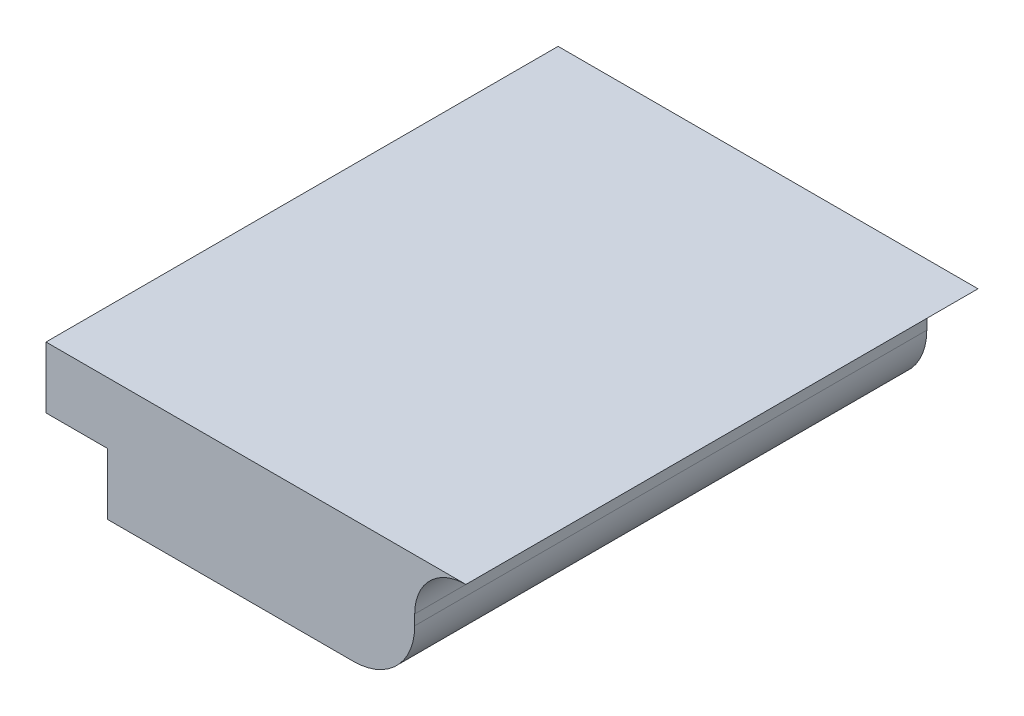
ISO-10303-21;
HEADER;
FILE_DESCRIPTION(('STEP AP214'),'2;1');
FILE_NAME('part.step','',(''),(''),'','','');
FILE_SCHEMA(('AUTOMOTIVE_DESIGN { 1 0 10303 214 1 1 1 1 }'));
ENDSEC;
DATA;
#1=APPLICATION_CONTEXT('core data for automotive mechanical design processes');
#2=APPLICATION_PROTOCOL_DEFINITION('international standard','automotive_design',2000,#1);
#3=PRODUCT_CONTEXT('',#1,'mechanical');
#4=PRODUCT('Part','Part','',(#3));
#5=PRODUCT_RELATED_PRODUCT_CATEGORY('part','',(#4));
#6=PRODUCT_DEFINITION_FORMATION('','',#4);
#7=PRODUCT_DEFINITION_CONTEXT('part definition',#1,'design');
#8=PRODUCT_DEFINITION('design','',#6,#7);
#9=PRODUCT_DEFINITION_SHAPE('','',#8);
#10=(LENGTH_UNIT() NAMED_UNIT(*) SI_UNIT(.MILLI.,.METRE.));
#11=(NAMED_UNIT(*) PLANE_ANGLE_UNIT() SI_UNIT($,.RADIAN.));
#12=(NAMED_UNIT(*) SI_UNIT($,.STERADIAN.) SOLID_ANGLE_UNIT());
#13=UNCERTAINTY_MEASURE_WITH_UNIT(LENGTH_MEASURE(1.E-05),#10,'distance_accuracy_value','');
#14=(GEOMETRIC_REPRESENTATION_CONTEXT(3) GLOBAL_UNCERTAINTY_ASSIGNED_CONTEXT((#13)) GLOBAL_UNIT_ASSIGNED_CONTEXT((#10,
#11,#12)) REPRESENTATION_CONTEXT('',''));
#15=CARTESIAN_POINT('',(0.,0.,0.));
#16=DIRECTION('',(0.,0.,1.));
#17=DIRECTION('',(1.,0.,0.));
#18=AXIS2_PLACEMENT_3D('',#15,#16,#17);
#19=CARTESIAN_POINT('',(9.,0.,12.5));
#20=DIRECTION('',(1.,0.,0.));
#21=DIRECTION('',(0.,0.,-1.));
#22=AXIS2_PLACEMENT_3D('',#19,#20,#21);
#23=PLANE('',#22);
#24=DIRECTION('',(0.,-1.,0.));
#25=VECTOR('',#24,1.);
#26=CARTESIAN_POINT('',(9.,0.,12.5));
#27=LINE('',#26,#25);
#28=CARTESIAN_POINT('',(9.,-2.5,12.5));
#29=VERTEX_POINT('',#28);
#30=CARTESIAN_POINT('',(9.,-3.,12.5));
#31=VERTEX_POINT('',#30);
#32=EDGE_CURVE('E118',#29,#31,#27,.T.);
#33=ORIENTED_EDGE('',*,*,#32,.T.);
#34=DIRECTION('',(0.,0.,-1.));
#35=VECTOR('',#34,1.);
#36=CARTESIAN_POINT('',(9.,-3.,12.5));
#37=LINE('',#36,#35);
#38=CARTESIAN_POINT('',(9.,-3.,-12.5));
#39=VERTEX_POINT('',#38);
#40=EDGE_CURVE('E124',#31,#39,#37,.T.);
#41=ORIENTED_EDGE('',*,*,#40,.T.);
#42=DIRECTION('',(0.,-1.,0.));
#43=VECTOR('',#42,1.);
#44=CARTESIAN_POINT('',(9.,0.,-12.5));
#45=LINE('',#44,#43);
#46=CARTESIAN_POINT('',(9.,-2.5,-12.5));
#47=VERTEX_POINT('',#46);
#48=EDGE_CURVE('E133',#47,#39,#45,.T.);
#49=ORIENTED_EDGE('',*,*,#48,.F.);
#50=DIRECTION('',(0.,0.,-1.));
#51=VECTOR('',#50,1.);
#52=CARTESIAN_POINT('',(9.,-2.5,12.5));
#53=LINE('',#52,#51);
#54=EDGE_CURVE('E108',#47,#29,#53,.F.);
#55=ORIENTED_EDGE('',*,*,#54,.T.);
#56=EDGE_LOOP('',(#33,#41,#49,#55));
#57=FACE_BOUND('',#56,.T.);
#58=ADVANCED_FACE('F36',(#57),#23,.T.);
#59=CARTESIAN_POINT('',(-9.,-3.,12.5));
#60=DIRECTION('',(-1.,0.,0.));
#61=DIRECTION('',(0.,0.,1.));
#62=AXIS2_PLACEMENT_3D('',#59,#60,#61);
#63=PLANE('',#62);
#64=DIRECTION('',(0.,1.,0.));
#65=VECTOR('',#64,1.);
#66=CARTESIAN_POINT('',(-9.,-3.,-12.5));
#67=LINE('',#66,#65);
#68=CARTESIAN_POINT('',(-9.,-3.,-12.5));
#69=VERTEX_POINT('',#68);
#70=CARTESIAN_POINT('',(-9.,0.,-12.5));
#71=VERTEX_POINT('',#70);
#72=EDGE_CURVE('E117',#69,#71,#67,.T.);
#73=ORIENTED_EDGE('',*,*,#72,.F.);
#74=DIRECTION('',(0.,0.,-1.));
#75=VECTOR('',#74,1.);
#76=CARTESIAN_POINT('',(-9.,-3.,12.5));
#77=LINE('',#76,#75);
#78=CARTESIAN_POINT('',(-9.,-3.,12.5));
#79=VERTEX_POINT('',#78);
#80=EDGE_CURVE('E162',#79,#69,#77,.T.);
#81=ORIENTED_EDGE('',*,*,#80,.F.);
#82=DIRECTION('',(0.,1.,0.));
#83=VECTOR('',#82,1.);
#84=CARTESIAN_POINT('',(-9.,-3.,12.5));
#85=LINE('',#84,#83);
#86=CARTESIAN_POINT('',(-9.,0.,12.5));
#87=VERTEX_POINT('',#86);
#88=EDGE_CURVE('E156',#79,#87,#85,.T.);
#89=ORIENTED_EDGE('',*,*,#88,.T.);
#90=DIRECTION('',(0.,0.,-1.));
#91=VECTOR('',#90,1.);
#92=CARTESIAN_POINT('',(-9.,0.,12.5));
#93=LINE('',#92,#91);
#94=EDGE_CURVE('E109',#87,#71,#93,.T.);
#95=ORIENTED_EDGE('',*,*,#94,.T.);
#96=EDGE_LOOP('',(#73,#81,#89,#95));
#97=FACE_BOUND('',#96,.T.);
#98=ADVANCED_FACE('F179',(#97),#63,.T.);
#99=CARTESIAN_POINT('',(-6.,-3.,12.5));
#100=DIRECTION('',(0.,-1.,0.));
#101=DIRECTION('',(1.,0.,0.));
#102=AXIS2_PLACEMENT_3D('',#99,#100,#101);
#103=PLANE('',#102);
#104=DIRECTION('',(-1.,0.,0.));
#105=VECTOR('',#104,1.);
#106=CARTESIAN_POINT('',(-6.,-3.,-12.5));
#107=LINE('',#106,#105);
#108=CARTESIAN_POINT('',(-6.,-3.,-12.5));
#109=VERTEX_POINT('',#108);
#110=EDGE_CURVE('E144',#109,#69,#107,.T.);
#111=ORIENTED_EDGE('',*,*,#110,.F.);
#112=DIRECTION('',(0.,0.,-1.));
#113=VECTOR('',#112,1.);
#114=CARTESIAN_POINT('',(-6.,-3.,12.5));
#115=LINE('',#114,#113);
#116=CARTESIAN_POINT('',(-6.,-3.,12.5));
#117=VERTEX_POINT('',#116);
#118=EDGE_CURVE('E164',#117,#109,#115,.T.);
#119=ORIENTED_EDGE('',*,*,#118,.F.);
#120=DIRECTION('',(-1.,0.,0.));
#121=VECTOR('',#120,1.);
#122=CARTESIAN_POINT('',(-6.,-3.,12.5));
#123=LINE('',#122,#121);
#124=EDGE_CURVE('E153',#117,#79,#123,.T.);
#125=ORIENTED_EDGE('',*,*,#124,.T.);
#126=ORIENTED_EDGE('',*,*,#80,.T.);
#127=EDGE_LOOP('',(#111,#119,#125,#126));
#128=FACE_BOUND('',#127,.T.);
#129=ADVANCED_FACE('F175',(#128),#103,.T.);
#130=CARTESIAN_POINT('',(-6.,-6.,12.5));
#131=DIRECTION('',(-1.,0.,0.));
#132=DIRECTION('',(0.,-1.,0.));
#133=AXIS2_PLACEMENT_3D('',#130,#131,#132);
#134=PLANE('',#133);
#135=DIRECTION('',(0.,1.,0.));
#136=VECTOR('',#135,1.);
#137=CARTESIAN_POINT('',(-6.,-6.,-12.5));
#138=LINE('',#137,#136);
#139=CARTESIAN_POINT('',(-6.,-6.,-12.5));
#140=VERTEX_POINT('',#139);
#141=EDGE_CURVE('E139',#140,#109,#138,.T.);
#142=ORIENTED_EDGE('',*,*,#141,.F.);
#143=DIRECTION('',(0.,0.,-1.));
#144=VECTOR('',#143,1.);
#145=CARTESIAN_POINT('',(-6.,-6.,12.5));
#146=LINE('',#145,#144);
#147=CARTESIAN_POINT('',(-6.,-6.,12.5));
#148=VERTEX_POINT('',#147);
#149=EDGE_CURVE('E160',#148,#140,#146,.T.);
#150=ORIENTED_EDGE('',*,*,#149,.F.);
#151=DIRECTION('',(0.,1.,0.));
#152=VECTOR('',#151,1.);
#153=CARTESIAN_POINT('',(-6.,-6.,12.5));
#154=LINE('',#153,#152);
#155=EDGE_CURVE('E150',#148,#117,#154,.T.);
#156=ORIENTED_EDGE('',*,*,#155,.T.);
#157=ORIENTED_EDGE('',*,*,#118,.T.);
#158=EDGE_LOOP('',(#142,#150,#156,#157));
#159=FACE_BOUND('',#158,.T.);
#160=ADVANCED_FACE('F172',(#159),#134,.T.);
#161=CARTESIAN_POINT('',(9.,-6.,12.5));
#162=DIRECTION('',(0.,-1.,0.));
#163=DIRECTION('',(1.,0.,0.));
#164=AXIS2_PLACEMENT_3D('',#161,#162,#163);
#165=PLANE('',#164);
#166=DIRECTION('',(-1.,0.,0.));
#167=VECTOR('',#166,1.);
#168=CARTESIAN_POINT('',(9.,-6.,-12.5));
#169=LINE('',#168,#167);
#170=CARTESIAN_POINT('',(6.,-6.,-12.5));
#171=VERTEX_POINT('',#170);
#172=EDGE_CURVE('E137',#171,#140,#169,.T.);
#173=ORIENTED_EDGE('',*,*,#172,.F.);
#174=DIRECTION('',(0.,0.,-1.));
#175=VECTOR('',#174,1.);
#176=CARTESIAN_POINT('',(6.,-6.,12.5));
#177=LINE('',#176,#175);
#178=CARTESIAN_POINT('',(6.,-6.,12.5));
#179=VERTEX_POINT('',#178);
#180=EDGE_CURVE('E43',#171,#179,#177,.F.);
#181=ORIENTED_EDGE('',*,*,#180,.T.);
#182=DIRECTION('',(-1.,0.,0.));
#183=VECTOR('',#182,1.);
#184=CARTESIAN_POINT('',(9.,-6.,12.5));
#185=LINE('',#184,#183);
#186=EDGE_CURVE('E148',#179,#148,#185,.T.);
#187=ORIENTED_EDGE('',*,*,#186,.T.);
#188=ORIENTED_EDGE('',*,*,#149,.T.);
#189=EDGE_LOOP('',(#173,#181,#187,#188));
#190=FACE_BOUND('',#189,.T.);
#191=ADVANCED_FACE('F169',(#190),#165,.T.);
#192=CARTESIAN_POINT('',(9.,-6.,12.5));
#193=DIRECTION('',(0.,0.,-1.));
#194=DIRECTION('',(-1.,0.,0.));
#195=AXIS2_PLACEMENT_3D('',#192,#193,#194);
#196=PLANE('',#195);
#197=ORIENTED_EDGE('',*,*,#186,.F.);
#198=CARTESIAN_POINT('',(6.,-3.,12.5));
#199=DIRECTION('',(0.,0.,-1.));
#200=DIRECTION('',(-1.,0.,0.));
#201=AXIS2_PLACEMENT_3D('',#198,#199,#200);
#202=CIRCLE('',#201,3.);
#203=EDGE_CURVE('E11',#179,#31,#202,.F.);
#204=ORIENTED_EDGE('',*,*,#203,.T.);
#205=ORIENTED_EDGE('',*,*,#32,.F.);
#206=CARTESIAN_POINT('',(11.5,-2.5,12.5));
#207=DIRECTION('',(0.,0.,-1.));
#208=DIRECTION('',(-1.,0.,0.));
#209=AXIS2_PLACEMENT_3D('',#206,#207,#208);
#210=CIRCLE('',#209,2.5);
#211=CARTESIAN_POINT('',(11.5,0.,12.5));
#212=VERTEX_POINT('',#211);
#213=EDGE_CURVE('E122',#29,#212,#210,.T.);
#214=ORIENTED_EDGE('',*,*,#213,.T.);
#215=DIRECTION('',(-1.,0.,0.));
#216=VECTOR('',#215,1.);
#217=CARTESIAN_POINT('',(9.,0.,12.5));
#218=LINE('',#217,#216);
#219=EDGE_CURVE('E103',#212,#87,#218,.T.);
#220=ORIENTED_EDGE('',*,*,#219,.T.);
#221=ORIENTED_EDGE('',*,*,#88,.F.);
#222=ORIENTED_EDGE('',*,*,#124,.F.);
#223=ORIENTED_EDGE('',*,*,#155,.F.);
#224=EDGE_LOOP('',(#197,#204,#205,#214,#220,#221,#222,#223));
#225=FACE_BOUND('',#224,.T.);
#226=ADVANCED_FACE('F181',(#225),#196,.F.);
#227=CARTESIAN_POINT('',(9.,-6.,-12.5));
#228=DIRECTION('',(0.,0.,-1.));
#229=DIRECTION('',(-1.,0.,0.));
#230=AXIS2_PLACEMENT_3D('',#227,#228,#229);
#231=PLANE('',#230);
#232=ORIENTED_EDGE('',*,*,#48,.T.);
#233=CARTESIAN_POINT('',(6.,-3.,-12.5));
#234=DIRECTION('',(0.,0.,-1.));
#235=DIRECTION('',(-1.,0.,0.));
#236=AXIS2_PLACEMENT_3D('',#233,#234,#235);
#237=CIRCLE('',#236,3.);
#238=EDGE_CURVE('E57',#39,#171,#237,.T.);
#239=ORIENTED_EDGE('',*,*,#238,.T.);
#240=ORIENTED_EDGE('',*,*,#172,.T.);
#241=ORIENTED_EDGE('',*,*,#141,.T.);
#242=ORIENTED_EDGE('',*,*,#110,.T.);
#243=ORIENTED_EDGE('',*,*,#72,.T.);
#244=DIRECTION('',(-1.,0.,0.));
#245=VECTOR('',#244,1.);
#246=CARTESIAN_POINT('',(9.,0.,-12.5));
#247=LINE('',#246,#245);
#248=CARTESIAN_POINT('',(11.5,0.,-12.5));
#249=VERTEX_POINT('',#248);
#250=EDGE_CURVE('E100',#249,#71,#247,.T.);
#251=ORIENTED_EDGE('',*,*,#250,.F.);
#252=CARTESIAN_POINT('',(11.5,-2.5,-12.5));
#253=DIRECTION('',(0.,0.,-1.));
#254=DIRECTION('',(-1.,0.,0.));
#255=AXIS2_PLACEMENT_3D('',#252,#253,#254);
#256=CIRCLE('',#255,2.5);
#257=EDGE_CURVE('E113',#249,#47,#256,.F.);
#258=ORIENTED_EDGE('',*,*,#257,.T.);
#259=EDGE_LOOP('',(#232,#239,#240,#241,#242,#243,#251,#258));
#260=FACE_BOUND('',#259,.T.);
#261=ADVANCED_FACE('F112',(#260),#231,.T.);
#262=CARTESIAN_POINT('',(11.5,-2.5,25.));
#263=DIRECTION('',(0.,0.,1.));
#264=DIRECTION('',(1.,0.,0.));
#265=AXIS2_PLACEMENT_3D('',#262,#263,#264);
#266=CYLINDRICAL_SURFACE('',#265,2.5);
#267=ORIENTED_EDGE('',*,*,#213,.F.);
#268=ORIENTED_EDGE('',*,*,#54,.F.);
#269=ORIENTED_EDGE('',*,*,#257,.F.);
#270=DIRECTION('',(0.,0.,-1.));
#271=VECTOR('',#270,1.);
#272=CARTESIAN_POINT('',(11.5,0.,-12.5));
#273=LINE('',#272,#271);
#274=EDGE_CURVE('E97',#212,#249,#273,.T.);
#275=ORIENTED_EDGE('',*,*,#274,.F.);
#276=EDGE_LOOP('',(#267,#268,#269,#275));
#277=FACE_BOUND('',#276,.T.);
#278=ADVANCED_FACE('F121',(#277),#266,.F.);
#279=CARTESIAN_POINT('',(6.,-3.,12.5));
#280=DIRECTION('',(0.,0.,-1.));
#281=DIRECTION('',(-1.,0.,0.));
#282=AXIS2_PLACEMENT_3D('',#279,#280,#281);
#283=CYLINDRICAL_SURFACE('',#282,3.);
#284=ORIENTED_EDGE('',*,*,#203,.F.);
#285=ORIENTED_EDGE('',*,*,#180,.F.);
#286=ORIENTED_EDGE('',*,*,#238,.F.);
#287=ORIENTED_EDGE('',*,*,#40,.F.);
#288=EDGE_LOOP('',(#284,#285,#286,#287));
#289=FACE_BOUND('',#288,.T.);
#290=ADVANCED_FACE('F182',(#289),#283,.T.);
#291=CARTESIAN_POINT('',(-25.,0.,25.));
#292=DIRECTION('',(0.,-1.,0.));
#293=DIRECTION('',(0.,0.,-1.));
#294=AXIS2_PLACEMENT_3D('',#291,#292,#293);
#295=PLANE('',#294);
#296=ORIENTED_EDGE('',*,*,#94,.F.);
#297=ORIENTED_EDGE('',*,*,#219,.F.);
#298=ORIENTED_EDGE('',*,*,#274,.T.);
#299=ORIENTED_EDGE('',*,*,#250,.T.);
#300=EDGE_LOOP('',(#296,#297,#298,#299));
#301=FACE_BOUND('',#300,.T.);
#302=ADVANCED_FACE('F99',(#301),#295,.F.);
#303=CLOSED_SHELL('',(#58,#98,#129,#160,#191,#226,#261,#278,#290,#302));
#304=MANIFOLD_SOLID_BREP('B2',#303);
#305=ADVANCED_BREP_SHAPE_REPRESENTATION('',(#18,#304),#14);
#306=SHAPE_DEFINITION_REPRESENTATION(#9,#305);
ENDSEC;
END-ISO-10303-21;
